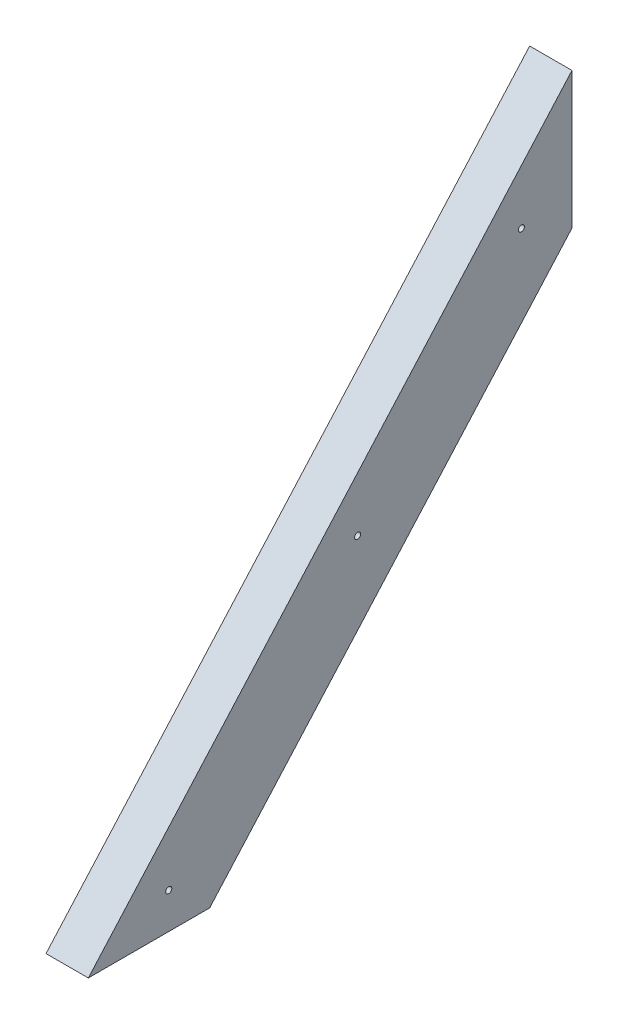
ISO-10303-21;
HEADER;
FILE_DESCRIPTION(('STEP AP214'),'2;1');
FILE_NAME('part.step','',(''),(''),'','','');
FILE_SCHEMA(('AUTOMOTIVE_DESIGN { 1 0 10303 214 1 1 1 1 }'));
ENDSEC;
DATA;
#1=APPLICATION_CONTEXT('core data for automotive mechanical design processes');
#2=APPLICATION_PROTOCOL_DEFINITION('international standard','automotive_design',2000,#1);
#3=PRODUCT_CONTEXT('',#1,'mechanical');
#4=PRODUCT('Part','Part','',(#3));
#5=PRODUCT_RELATED_PRODUCT_CATEGORY('part','',(#4));
#6=PRODUCT_DEFINITION_FORMATION('','',#4);
#7=PRODUCT_DEFINITION_CONTEXT('part definition',#1,'design');
#8=PRODUCT_DEFINITION('design','',#6,#7);
#9=PRODUCT_DEFINITION_SHAPE('','',#8);
#10=(LENGTH_UNIT() NAMED_UNIT(*) SI_UNIT(.MILLI.,.METRE.));
#11=(NAMED_UNIT(*) PLANE_ANGLE_UNIT() SI_UNIT($,.RADIAN.));
#12=(NAMED_UNIT(*) SI_UNIT($,.STERADIAN.) SOLID_ANGLE_UNIT());
#13=UNCERTAINTY_MEASURE_WITH_UNIT(LENGTH_MEASURE(1.E-05),#10,'distance_accuracy_value','');
#14=(GEOMETRIC_REPRESENTATION_CONTEXT(3) GLOBAL_UNCERTAINTY_ASSIGNED_CONTEXT((#13)) GLOBAL_UNIT_ASSIGNED_CONTEXT((#10,
#11,#12)) REPRESENTATION_CONTEXT('',''));
#15=CARTESIAN_POINT('',(0.,0.,0.));
#16=DIRECTION('',(0.,0.,1.));
#17=DIRECTION('',(1.,0.,0.));
#18=AXIS2_PLACEMENT_3D('',#15,#16,#17);
#19=CARTESIAN_POINT('',(-9.398,534.500854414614,-162.180159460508));
#20=DIRECTION('',(1.,0.,0.));
#21=DIRECTION('',(0.,0.,-1.));
#22=AXIS2_PLACEMENT_3D('',#19,#20,#21);
#23=PLANE('',#22);
#24=CARTESIAN_POINT('',(-9.398,534.500854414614,-162.180159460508));
#25=DIRECTION('',(1.,0.,0.));
#26=DIRECTION('',(0.,0.,-1.));
#27=AXIS2_PLACEMENT_3D('',#24,#25,#26);
#28=CIRCLE('',#27,1.27000000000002);
#29=CARTESIAN_POINT('',(-9.398,534.500854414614,-163.450159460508));
#30=VERTEX_POINT('',#29);
#31=EDGE_CURVE('E18',#30,#30,#28,.T.);
#32=ORIENTED_EDGE('',*,*,#31,.T.);
#33=EDGE_LOOP('',(#32));
#34=FACE_BOUND('',#33,.T.);
#35=ADVANCED_FACE('F15',(#34),#23,.T.);
#36=CARTESIAN_POINT('',(-9.398,457.083492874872,-93.364726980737));
#37=DIRECTION('',(1.,0.,0.));
#38=DIRECTION('',(0.,0.,-1.));
#39=AXIS2_PLACEMENT_3D('',#36,#37,#38);
#40=PLANE('',#39);
#41=CARTESIAN_POINT('',(-9.398,457.083492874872,-93.364726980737));
#42=DIRECTION('',(1.,0.,0.));
#43=DIRECTION('',(0.,0.,-1.));
#44=AXIS2_PLACEMENT_3D('',#41,#42,#43);
#45=CIRCLE('',#44,1.27000000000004);
#46=CARTESIAN_POINT('',(-9.398,457.083492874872,-94.6347269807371));
#47=VERTEX_POINT('',#46);
#48=EDGE_CURVE('E92',#47,#47,#45,.T.);
#49=ORIENTED_EDGE('',*,*,#48,.T.);
#50=EDGE_LOOP('',(#49));
#51=FACE_BOUND('',#50,.T.);
#52=ADVANCED_FACE('F114',(#51),#40,.T.);
#53=CARTESIAN_POINT('',(-9.398,367.823830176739,-14.0228045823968));
#54=DIRECTION('',(1.,0.,0.));
#55=DIRECTION('',(0.,0.,-1.));
#56=AXIS2_PLACEMENT_3D('',#53,#54,#55);
#57=PLANE('',#56);
#58=CARTESIAN_POINT('',(-9.398,367.823830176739,-14.0228045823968));
#59=DIRECTION('',(1.,0.,0.));
#60=DIRECTION('',(0.,0.,-1.));
#61=AXIS2_PLACEMENT_3D('',#58,#59,#60);
#62=CIRCLE('',#61,1.27000000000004);
#63=CARTESIAN_POINT('',(-9.398,367.823830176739,-15.2928045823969));
#64=VERTEX_POINT('',#63);
#65=EDGE_CURVE('E90',#64,#64,#62,.T.);
#66=ORIENTED_EDGE('',*,*,#65,.T.);
#67=EDGE_LOOP('',(#66));
#68=FACE_BOUND('',#67,.T.);
#69=ADVANCED_FACE('F103',(#68),#57,.T.);
#70=CARTESIAN_POINT('',(-9.398,534.500854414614,-162.180159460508));
#71=DIRECTION('',(1.,0.,0.));
#72=DIRECTION('',(0.,0.,-1.));
#73=AXIS2_PLACEMENT_3D('',#70,#71,#72);
#74=CYLINDRICAL_SURFACE('',#73,1.27000000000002);
#75=CARTESIAN_POINT('',(0.,534.500854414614,-162.180159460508));
#76=DIRECTION('',(1.,0.,0.));
#77=DIRECTION('',(0.,0.,-1.));
#78=AXIS2_PLACEMENT_3D('',#75,#76,#77);
#79=CIRCLE('',#78,1.27000000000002);
#80=CARTESIAN_POINT('',(0.,534.500854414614,-163.450159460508));
#81=VERTEX_POINT('',#80);
#82=EDGE_CURVE('E87',#81,#81,#79,.T.);
#83=ORIENTED_EDGE('',*,*,#82,.T.);
#84=EDGE_LOOP('',(#83));
#85=FACE_BOUND('',#84,.T.);
#86=ORIENTED_EDGE('',*,*,#31,.F.);
#87=EDGE_LOOP('',(#86));
#88=FACE_BOUND('',#87,.T.);
#89=ADVANCED_FACE('F100',(#85,#88),#74,.F.);
#90=CARTESIAN_POINT('',(-9.398,457.083492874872,-93.364726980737));
#91=DIRECTION('',(1.,0.,0.));
#92=DIRECTION('',(0.,0.,-1.));
#93=AXIS2_PLACEMENT_3D('',#90,#91,#92);
#94=CYLINDRICAL_SURFACE('',#93,1.27000000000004);
#95=CARTESIAN_POINT('',(0.,457.083492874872,-93.364726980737));
#96=DIRECTION('',(1.,0.,0.));
#97=DIRECTION('',(0.,0.,-1.));
#98=AXIS2_PLACEMENT_3D('',#95,#96,#97);
#99=CIRCLE('',#98,1.27000000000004);
#100=CARTESIAN_POINT('',(0.,457.083492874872,-94.6347269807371));
#101=VERTEX_POINT('',#100);
#102=EDGE_CURVE('E84',#101,#101,#99,.T.);
#103=ORIENTED_EDGE('',*,*,#102,.T.);
#104=EDGE_LOOP('',(#103));
#105=FACE_BOUND('',#104,.T.);
#106=ORIENTED_EDGE('',*,*,#48,.F.);
#107=EDGE_LOOP('',(#106));
#108=FACE_BOUND('',#107,.T.);
#109=ADVANCED_FACE('F102',(#105,#108),#94,.F.);
#110=CARTESIAN_POINT('',(-9.398,367.823830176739,-14.0228045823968));
#111=DIRECTION('',(1.,0.,0.));
#112=DIRECTION('',(0.,0.,-1.));
#113=AXIS2_PLACEMENT_3D('',#110,#111,#112);
#114=CYLINDRICAL_SURFACE('',#113,1.27000000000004);
#115=CARTESIAN_POINT('',(0.,367.823830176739,-14.0228045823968));
#116=DIRECTION('',(1.,0.,0.));
#117=DIRECTION('',(0.,0.,-1.));
#118=AXIS2_PLACEMENT_3D('',#115,#116,#117);
#119=CIRCLE('',#118,1.27000000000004);
#120=CARTESIAN_POINT('',(0.,367.823830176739,-15.2928045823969));
#121=VERTEX_POINT('',#120);
#122=EDGE_CURVE('E67',#121,#121,#119,.T.);
#123=ORIENTED_EDGE('',*,*,#122,.T.);
#124=EDGE_LOOP('',(#123));
#125=FACE_BOUND('',#124,.T.);
#126=ORIENTED_EDGE('',*,*,#65,.F.);
#127=EDGE_LOOP('',(#126));
#128=FACE_BOUND('',#127,.T.);
#129=ADVANCED_FACE('F111',(#125,#128),#114,.F.);
#130=CARTESIAN_POINT('',(0.,0.,0.));
#131=DIRECTION('',(-1.,0.,0.));
#132=DIRECTION('',(0.,0.,1.));
#133=AXIS2_PLACEMENT_3D('',#130,#131,#132);
#134=PLANE('',#133);
#135=DIRECTION('',(0.,0.747409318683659,-0.664363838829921));
#136=VECTOR('',#135,1.);
#137=CARTESIAN_POINT('',(0.,140.199423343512,157.724351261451));
#138=LINE('',#137,#136);
#139=CARTESIAN_POINT('',(0.,524.004117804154,-183.43537714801));
#140=VERTEX_POINT('',#139);
#141=CARTESIAN_POINT('',(0.,352.752211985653,-31.2114608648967));
#142=VERTEX_POINT('',#141);
#143=EDGE_CURVE('E206',#140,#142,#138,.F.);
#144=ORIENTED_EDGE('',*,*,#143,.F.);
#145=DIRECTION('',(0.,-1.,0.));
#146=VECTOR('',#145,1.);
#147=CARTESIAN_POINT('',(0.,0.,-183.43537714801));
#148=LINE('',#147,#146);
#149=CARTESIAN_POINT('',(0.,581.352211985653,-183.43537714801));
#150=VERTEX_POINT('',#149);
#151=EDGE_CURVE('E71',#140,#150,#148,.F.);
#152=ORIENTED_EDGE('',*,*,#151,.T.);
#153=DIRECTION('',(0.,0.747409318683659,-0.664363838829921));
#154=VECTOR('',#153,1.);
#155=CARTESIAN_POINT('',(0.,165.511685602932,186.200646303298));
#156=LINE('',#155,#154);
#157=CARTESIAN_POINT('',(0.,352.752211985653,19.7646228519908));
#158=VERTEX_POINT('',#157);
#159=EDGE_CURVE('E54',#150,#158,#156,.F.);
#160=ORIENTED_EDGE('',*,*,#159,.T.);
#161=DIRECTION('',(0.,0.,-1.));
#162=VECTOR('',#161,1.);
#163=CARTESIAN_POINT('',(0.,352.752211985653,0.));
#164=LINE('',#163,#162);
#165=EDGE_CURVE('E59',#142,#158,#164,.F.);
#166=ORIENTED_EDGE('',*,*,#165,.F.);
#167=EDGE_LOOP('',(#144,#152,#160,#166));
#168=FACE_BOUND('',#167,.T.);
#169=ORIENTED_EDGE('',*,*,#122,.F.);
#170=EDGE_LOOP('',(#169));
#171=FACE_BOUND('',#170,.T.);
#172=ORIENTED_EDGE('',*,*,#102,.F.);
#173=EDGE_LOOP('',(#172));
#174=FACE_BOUND('',#173,.T.);
#175=ORIENTED_EDGE('',*,*,#82,.F.);
#176=EDGE_LOOP('',(#175));
#177=FACE_BOUND('',#176,.T.);
#178=ADVANCED_FACE('F69',(#168,#171,#174,#177),#134,.F.);
#179=CARTESIAN_POINT('',(-17.78,352.752211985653,0.));
#180=DIRECTION('',(0.,-1.,0.));
#181=DIRECTION('',(0.,0.,-1.));
#182=AXIS2_PLACEMENT_3D('',#179,#180,#181);
#183=PLANE('',#182);
#184=DIRECTION('',(0.,0.,1.));
#185=VECTOR('',#184,1.);
#186=CARTESIAN_POINT('',(-17.78,352.752211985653,0.));
#187=LINE('',#186,#185);
#188=CARTESIAN_POINT('',(-17.78,352.752211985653,-31.2114608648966));
#189=VERTEX_POINT('',#188);
#190=CARTESIAN_POINT('',(-17.78,352.752211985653,19.7646228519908));
#191=VERTEX_POINT('',#190);
#192=EDGE_CURVE('E200',#189,#191,#187,.T.);
#193=ORIENTED_EDGE('',*,*,#192,.F.);
#194=DIRECTION('',(1.,0.,0.));
#195=VECTOR('',#194,1.);
#196=CARTESIAN_POINT('',(-17.78,352.752211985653,-31.2114608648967));
#197=LINE('',#196,#195);
#198=EDGE_CURVE('E64',#142,#189,#197,.F.);
#199=ORIENTED_EDGE('',*,*,#198,.F.);
#200=ORIENTED_EDGE('',*,*,#165,.T.);
#201=DIRECTION('',(1.,0.,0.));
#202=VECTOR('',#201,1.);
#203=CARTESIAN_POINT('',(-17.78,352.752211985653,19.7646228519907));
#204=LINE('',#203,#202);
#205=EDGE_CURVE('E61',#158,#191,#204,.F.);
#206=ORIENTED_EDGE('',*,*,#205,.T.);
#207=EDGE_LOOP('',(#193,#199,#200,#206));
#208=FACE_BOUND('',#207,.T.);
#209=ADVANCED_FACE('F60',(#208),#183,.T.);
#210=CARTESIAN_POINT('',(-17.78,165.511685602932,186.200646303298));
#211=DIRECTION('',(0.,-0.664363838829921,-0.747409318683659));
#212=DIRECTION('',(0.,0.747409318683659,-0.664363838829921));
#213=AXIS2_PLACEMENT_3D('',#210,#211,#212);
#214=PLANE('',#213);
#215=DIRECTION('',(1.,0.,0.));
#216=VECTOR('',#215,1.);
#217=CARTESIAN_POINT('',(-17.78,581.352211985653,-183.43537714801));
#218=LINE('',#217,#216);
#219=CARTESIAN_POINT('',(-17.78,581.352211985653,-183.43537714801));
#220=VERTEX_POINT('',#219);
#221=EDGE_CURVE('E73',#150,#220,#218,.F.);
#222=ORIENTED_EDGE('',*,*,#221,.T.);
#223=DIRECTION('',(0.,0.747409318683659,-0.664363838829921));
#224=VECTOR('',#223,1.);
#225=CARTESIAN_POINT('',(-17.78,352.752211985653,19.7646228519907));
#226=LINE('',#225,#224);
#227=EDGE_CURVE('E77',#191,#220,#226,.T.);
#228=ORIENTED_EDGE('',*,*,#227,.F.);
#229=ORIENTED_EDGE('',*,*,#205,.F.);
#230=ORIENTED_EDGE('',*,*,#159,.F.);
#231=EDGE_LOOP('',(#222,#228,#229,#230));
#232=FACE_BOUND('',#231,.T.);
#233=ADVANCED_FACE('F75',(#232),#214,.F.);
#234=CARTESIAN_POINT('',(-17.78,0.,-183.43537714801));
#235=DIRECTION('',(0.,0.,1.));
#236=DIRECTION('',(0.,-1.,0.));
#237=AXIS2_PLACEMENT_3D('',#234,#235,#236);
#238=PLANE('',#237);
#239=DIRECTION('',(1.,0.,0.));
#240=VECTOR('',#239,1.);
#241=CARTESIAN_POINT('',(-17.78,524.004117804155,-183.43537714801));
#242=LINE('',#241,#240);
#243=CARTESIAN_POINT('',(-17.78,524.004117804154,-183.43537714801));
#244=VERTEX_POINT('',#243);
#245=EDGE_CURVE('E33',#244,#140,#242,.T.);
#246=ORIENTED_EDGE('',*,*,#245,.F.);
#247=DIRECTION('',(0.,1.,0.));
#248=VECTOR('',#247,1.);
#249=CARTESIAN_POINT('',(-17.78,0.,-183.43537714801));
#250=LINE('',#249,#248);
#251=EDGE_CURVE('E24',#220,#244,#250,.F.);
#252=ORIENTED_EDGE('',*,*,#251,.F.);
#253=ORIENTED_EDGE('',*,*,#221,.F.);
#254=ORIENTED_EDGE('',*,*,#151,.F.);
#255=EDGE_LOOP('',(#246,#252,#253,#254));
#256=FACE_BOUND('',#255,.T.);
#257=ADVANCED_FACE('F125',(#256),#238,.F.);
#258=CARTESIAN_POINT('',(-17.78,140.199423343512,157.724351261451));
#259=DIRECTION('',(0.,-0.664363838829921,-0.747409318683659));
#260=DIRECTION('',(0.,0.747409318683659,-0.664363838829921));
#261=AXIS2_PLACEMENT_3D('',#258,#259,#260);
#262=PLANE('',#261);
#263=DIRECTION('',(0.,-0.747409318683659,0.664363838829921));
#264=VECTOR('',#263,1.);
#265=CARTESIAN_POINT('',(-17.78,524.004117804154,-183.43537714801));
#266=LINE('',#265,#264);
#267=EDGE_CURVE('E9',#244,#189,#266,.T.);
#268=ORIENTED_EDGE('',*,*,#267,.F.);
#269=ORIENTED_EDGE('',*,*,#245,.T.);
#270=ORIENTED_EDGE('',*,*,#143,.T.);
#271=ORIENTED_EDGE('',*,*,#198,.T.);
#272=EDGE_LOOP('',(#268,#269,#270,#271));
#273=FACE_BOUND('',#272,.T.);
#274=ADVANCED_FACE('F119',(#273),#262,.T.);
#275=CARTESIAN_POINT('',(-17.78,0.,0.));
#276=DIRECTION('',(-1.,0.,0.));
#277=DIRECTION('',(0.,0.,1.));
#278=AXIS2_PLACEMENT_3D('',#275,#276,#277);
#279=PLANE('',#278);
#280=ORIENTED_EDGE('',*,*,#251,.T.);
#281=ORIENTED_EDGE('',*,*,#267,.T.);
#282=ORIENTED_EDGE('',*,*,#192,.T.);
#283=ORIENTED_EDGE('',*,*,#227,.T.);
#284=EDGE_LOOP('',(#280,#281,#282,#283));
#285=FACE_BOUND('',#284,.T.);
#286=ADVANCED_FACE('F117',(#285),#279,.T.);
#287=CLOSED_SHELL('',(#35,#52,#69,#89,#109,#129,#178,#209,#233,#257,#274,#286));
#288=MANIFOLD_SOLID_BREP('B1',#287);
#289=ADVANCED_BREP_SHAPE_REPRESENTATION('',(#18,#288),#14);
#290=SHAPE_DEFINITION_REPRESENTATION(#9,#289);
ENDSEC;
END-ISO-10303-21;
